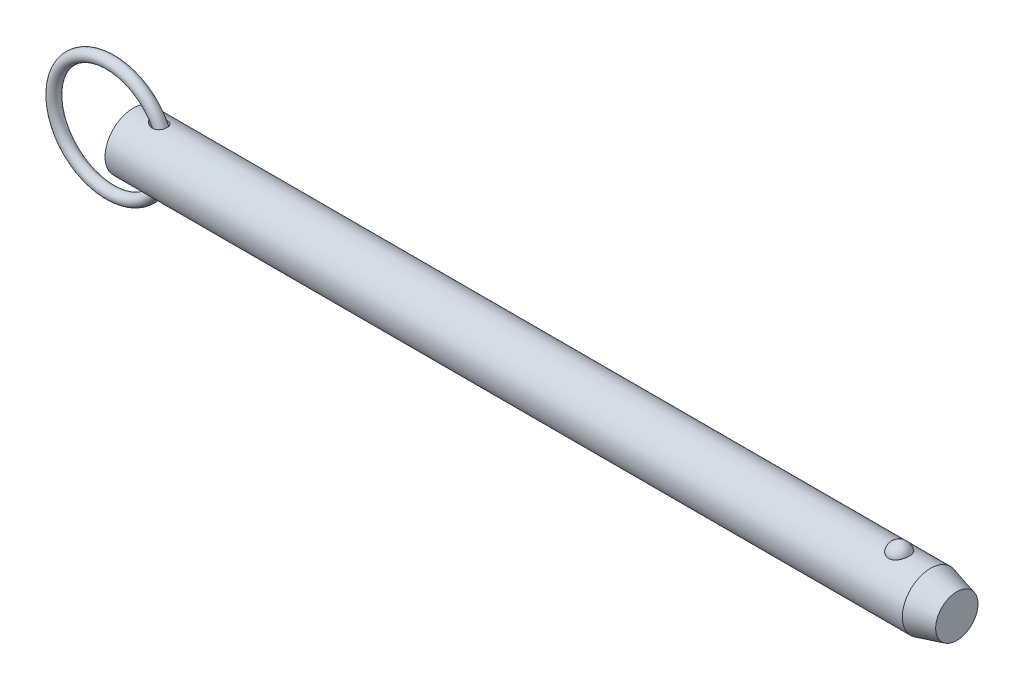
ISO-10303-21;
HEADER;
FILE_DESCRIPTION(('STEP AP214'),'2;1');
FILE_NAME('part.step','',(''),(''),'','','');
FILE_SCHEMA(('AUTOMOTIVE_DESIGN { 1 0 10303 214 1 1 1 1 }'));
ENDSEC;
DATA;
#1=APPLICATION_CONTEXT('core data for automotive mechanical design processes');
#2=APPLICATION_PROTOCOL_DEFINITION('international standard','automotive_design',2000,#1);
#3=PRODUCT_CONTEXT('',#1,'mechanical');
#4=PRODUCT('Part','Part','',(#3));
#5=PRODUCT_RELATED_PRODUCT_CATEGORY('part','',(#4));
#6=PRODUCT_DEFINITION_FORMATION('','',#4);
#7=PRODUCT_DEFINITION_CONTEXT('part definition',#1,'design');
#8=PRODUCT_DEFINITION('design','',#6,#7);
#9=PRODUCT_DEFINITION_SHAPE('','',#8);
#10=(LENGTH_UNIT() NAMED_UNIT(*) SI_UNIT(.MILLI.,.METRE.));
#11=(NAMED_UNIT(*) PLANE_ANGLE_UNIT() SI_UNIT($,.RADIAN.));
#12=(NAMED_UNIT(*) SI_UNIT($,.STERADIAN.) SOLID_ANGLE_UNIT());
#13=UNCERTAINTY_MEASURE_WITH_UNIT(LENGTH_MEASURE(1.E-05),#10,'distance_accuracy_value','');
#14=(GEOMETRIC_REPRESENTATION_CONTEXT(3) GLOBAL_UNCERTAINTY_ASSIGNED_CONTEXT((#13)) GLOBAL_UNIT_ASSIGNED_CONTEXT((#10,
#11,#12)) REPRESENTATION_CONTEXT('',''));
#15=CARTESIAN_POINT('',(0.,0.,0.));
#16=DIRECTION('',(0.,0.,1.));
#17=DIRECTION('',(1.,0.,0.));
#18=AXIS2_PLACEMENT_3D('',#15,#16,#17);
#19=CARTESIAN_POINT('',(-6.46799987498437,0.,0.));
#20=DIRECTION('',(0.,0.,1.));
#21=DIRECTION('',(1.,0.,0.));
#22=AXIS2_PLACEMENT_3D('',#19,#20,#21);
#23=TOROIDAL_SURFACE('',#22,15.875,1.588);
#24=CARTESIAN_POINT('',(10.9950001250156,0.,0.));
#25=VERTEX_POINT('',#24);
#26=VERTEX_LOOP('',#25);
#27=FACE_BOUND('',#26,.T.);
#28=ADVANCED_FACE('P0_F12',(#27),#23,.T.);
#29=CLOSED_SHELL('',(#28));
#30=MANIFOLD_SOLID_BREP('P0_B1',#29);
#31=CARTESIAN_POINT('',(0.,0.,0.));
#32=DIRECTION('',(1.,0.,0.));
#33=DIRECTION('',(0.,0.,-1.));
#34=AXIS2_PLACEMENT_3D('',#31,#32,#33);
#35=CYLINDRICAL_SURFACE('',#34,7.94);
#36=CARTESIAN_POINT('',(4.99454278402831,7.92831028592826,-0.430692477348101));
#37=CARTESIAN_POINT('',(5.02621962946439,7.92271974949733,-0.533554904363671));
#38=CARTESIAN_POINT('',(5.06869972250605,7.91528872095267,-0.633052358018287));
#39=CARTESIAN_POINT('',(5.17094751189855,7.89785690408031,-0.822566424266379));
#40=CARTESIAN_POINT('',(5.23077290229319,7.88784755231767,-0.912550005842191));
#41=CARTESIAN_POINT('',(5.37866013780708,7.8639674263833,-1.10117829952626));
#42=CARTESIAN_POINT('',(5.47004908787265,7.84973599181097,-1.19714712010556));
#43=CARTESIAN_POINT('',(5.66695490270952,7.82090787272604,-1.37293476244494));
#44=CARTESIAN_POINT('',(5.77247743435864,7.80631104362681,-1.45274707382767));
#45=CARTESIAN_POINT('',(5.99604254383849,7.77793596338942,-1.59776875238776));
#46=CARTESIAN_POINT('',(6.11428384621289,7.76417836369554,-1.66267404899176));
#47=CARTESIAN_POINT('',(6.35882685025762,7.73912410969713,-1.77564129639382));
#48=CARTESIAN_POINT('',(6.48513256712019,7.72782869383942,-1.82369477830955));
#49=CARTESIAN_POINT('',(6.76898453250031,7.70705630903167,-1.90977520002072));
#50=CARTESIAN_POINT('',(6.92778004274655,7.69837706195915,-1.94395681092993));
#51=CARTESIAN_POINT('',(7.24915504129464,7.6881294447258,-1.98412381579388));
#52=CARTESIAN_POINT('',(7.41173039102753,7.68655363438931,-1.99013871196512));
#53=CARTESIAN_POINT('',(7.697714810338,7.69094561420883,-1.97306069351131));
#54=CARTESIAN_POINT('',(7.82153338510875,7.69526202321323,-1.95634328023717));
#55=CARTESIAN_POINT('',(8.06460511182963,7.70859273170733,-1.90314615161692));
#56=CARTESIAN_POINT('',(8.18386164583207,7.7176034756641,-1.86668139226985));
#57=CARTESIAN_POINT('',(8.41450663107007,7.73959050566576,-1.77331230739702));
#58=CARTESIAN_POINT('',(8.52585042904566,7.75258738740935,-1.71630154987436));
#59=CARTESIAN_POINT('',(8.73575290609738,7.7809705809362,-1.58263416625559));
#60=CARTESIAN_POINT('',(8.83431445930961,7.7963563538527,-1.50598196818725));
#61=CARTESIAN_POINT('',(9.00639839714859,7.8259635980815,-1.34315626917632));
#62=CARTESIAN_POINT('',(9.08139772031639,7.84016008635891,-1.25853389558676));
#63=CARTESIAN_POINT('',(9.21545590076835,7.86710959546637,-1.07729126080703));
#64=CARTESIAN_POINT('',(9.27451869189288,7.87986297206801,-0.980673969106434));
#65=CARTESIAN_POINT('',(9.37315031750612,7.90198817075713,-0.782161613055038));
#66=CARTESIAN_POINT('',(9.41336512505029,7.91146854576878,-0.68059867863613));
#67=CARTESIAN_POINT('',(9.47650914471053,7.92664976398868,-0.471967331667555));
#68=CARTESIAN_POINT('',(9.49943917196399,7.93235078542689,-0.364899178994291));
#69=CARTESIAN_POINT('',(9.5274466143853,7.93934369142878,-0.14863226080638));
#70=CARTESIAN_POINT('',(9.53257574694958,7.9406483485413,-0.0394405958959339));
#71=CARTESIAN_POINT('',(9.52501411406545,7.93874464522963,0.178286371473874));
#72=CARTESIAN_POINT('',(9.51232314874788,7.93553623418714,0.286821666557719));
#73=CARTESIAN_POINT('',(9.46937875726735,7.92494527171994,0.500278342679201));
#74=CARTESIAN_POINT('',(9.43910562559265,7.9175580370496,0.605195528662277));
#75=CARTESIAN_POINT('',(9.36168926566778,7.8994090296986,0.808294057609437));
#76=CARTESIAN_POINT('',(9.3145467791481,7.88864740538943,0.906475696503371));
#77=CARTESIAN_POINT('',(9.20464679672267,7.86494645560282,1.09319438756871));
#78=CARTESIAN_POINT('',(9.14191093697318,7.85201015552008,1.18174456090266));
#79=CARTESIAN_POINT('',(9.00249124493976,7.82536913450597,1.34692675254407));
#80=CARTESIAN_POINT('',(8.92580850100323,7.81166447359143,1.42355969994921));
#81=CARTESIAN_POINT('',(8.76033130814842,7.78490157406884,1.56333296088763));
#82=CARTESIAN_POINT('',(8.67148512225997,7.77184644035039,1.62641250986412));
#83=CARTESIAN_POINT('',(8.48457694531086,7.74778101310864,1.73744892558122));
#84=CARTESIAN_POINT('',(8.38651410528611,7.73677090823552,1.78540439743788));
#85=CARTESIAN_POINT('',(8.18013312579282,7.71742695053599,1.86728938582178));
#86=CARTESIAN_POINT('',(8.07156725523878,7.7092102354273,1.90061897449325));
#87=CARTESIAN_POINT('',(7.85050876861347,7.6966502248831,1.95085652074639));
#88=CARTESIAN_POINT('',(7.73801453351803,7.69230854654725,1.967757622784));
#89=CARTESIAN_POINT('',(7.50002163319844,7.6873799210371,1.98693391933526));
#90=CARTESIAN_POINT('',(7.37438052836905,7.68722739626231,1.98751701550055));
#91=CARTESIAN_POINT('',(7.12435864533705,7.69142268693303,1.97121025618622));
#92=CARTESIAN_POINT('',(6.99997834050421,7.6957721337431,1.9543140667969));
#93=CARTESIAN_POINT('',(6.73521978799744,7.70925573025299,1.90049277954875));
#94=CARTESIAN_POINT('',(6.59543541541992,7.71903968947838,1.86081454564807));
#95=CARTESIAN_POINT('',(6.32319848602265,7.74233460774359,1.76138158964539));
#96=CARTESIAN_POINT('',(6.19076082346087,7.75585282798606,1.7015877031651));
#97=CARTESIAN_POINT('',(5.99269110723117,7.7785835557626,1.59336057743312));
#98=CARTESIAN_POINT('',(5.92332049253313,7.78707101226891,1.55151799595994));
#99=CARTESIAN_POINT('',(5.78862576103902,7.80440479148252,1.46183267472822));
#100=CARTESIAN_POINT('',(5.72330291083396,7.81325122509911,1.41398807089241));
#101=CARTESIAN_POINT('',(5.53492618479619,7.83980388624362,1.26162857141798));
#102=CARTESIAN_POINT('',(5.41884115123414,7.85759887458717,1.14795556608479));
#103=CARTESIAN_POINT('',(5.25731156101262,7.88350844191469,0.948390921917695));
#104=CARTESIAN_POINT('',(5.20241173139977,7.89260196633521,0.87019982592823));
#105=CARTESIAN_POINT('',(5.10541071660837,7.90897737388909,0.70602680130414));
#106=CARTESIAN_POINT('',(5.06329682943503,7.91626105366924,0.620052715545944));
#107=CARTESIAN_POINT('',(4.99458837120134,7.92827352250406,0.440665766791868));
#108=CARTESIAN_POINT('',(4.96816655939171,7.93297382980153,0.347182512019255));
#109=CARTESIAN_POINT('',(4.94275291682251,7.93751024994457,0.204498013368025));
#110=CARTESIAN_POINT('',(4.93665149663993,7.9386033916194,0.156529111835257));
#111=CARTESIAN_POINT('',(4.92932198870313,7.93991739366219,0.0602142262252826));
#112=CARTESIAN_POINT('',(4.92809242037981,7.94013851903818,0.011868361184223));
#113=CARTESIAN_POINT('',(4.93104052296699,7.93960920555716,-0.103241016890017));
#114=CARTESIAN_POINT('',(4.93747289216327,7.93845361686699,-0.169956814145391));
#115=CARTESIAN_POINT('',(4.95939910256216,7.93453812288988,-0.301777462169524));
#116=CARTESIAN_POINT('',(4.97489225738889,7.9317783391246,-0.36688243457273));
#117=CARTESIAN_POINT('',(4.99454278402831,7.92831028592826,-0.430692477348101));
#118=B_SPLINE_CURVE_WITH_KNOTS('',3,(#36,#37,#38,#39,#40,#41,#42,#43,#44,#45,#46,#47,#48,#49,
#50,#51,#52,#53,#54,#55,#56,#57,#58,#59,#60,#61,#62,#63,#64,#65,#66,#67,#68,#69,#70,#71,#72,#73,
#74,#75,#76,#77,#78,#79,#80,#81,#82,#83,#84,#85,#86,#87,#88,#89,#90,#91,#92,#93,#94,#95,#96,#97,
#98,#99,#100,#101,#102,#103,#104,#105,#106,#107,#108,#109,#110,#111,#112,#113,#114,#115,#116,
#117),.UNSPECIFIED.,.T.,.F.,(4,2,2,2,2,2,2,2,2,2,2,2,2,2,2,2,2,2,2,2,2,2,2,2,2,2,2,2,2,2,2,2,2,
2,2,2,2,2,2,2,4),(0.,0.323000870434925,0.647088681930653,1.04479679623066,1.4426648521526,
1.84804279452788,2.25362416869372,2.73917777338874,3.2242226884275,3.59772765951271,
3.97095014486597,4.34613445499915,4.72123425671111,5.06140749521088,5.40149668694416,
5.72887751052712,6.05624289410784,6.38265637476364,6.70907351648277,7.03585720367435,
7.36262652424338,7.68894495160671,8.01523792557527,8.34296459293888,8.67072147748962,
9.01089033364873,9.35120108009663,9.72668268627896,10.1023004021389,10.5375309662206,
10.9736138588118,11.2176803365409,11.461822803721,11.9480055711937,12.2349837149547,
12.5216758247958,12.8114683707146,12.9563497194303,13.1011870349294,13.3015737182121,
13.5019452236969),.UNSPECIFIED.);
#119=CARTESIAN_POINT('',(4.99454278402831,7.92831028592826,-0.430692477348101));
#120=VERTEX_POINT('',#119);
#121=EDGE_CURVE('P1_E40',#120,#120,#118,.T.);
#122=ORIENTED_EDGE('',*,*,#121,.T.);
#123=EDGE_LOOP('',(#122));
#124=FACE_BOUND('',#123,.T.);
#125=CARTESIAN_POINT('',(224.371879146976,0.,0.));
#126=DIRECTION('',(1.,0.,0.));
#127=DIRECTION('',(0.,0.,-1.));
#128=AXIS2_PLACEMENT_3D('',#125,#126,#127);
#129=CIRCLE('',#128,7.94);
#130=CARTESIAN_POINT('',(224.371879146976,0.,-7.94));
#131=VERTEX_POINT('',#130);
#132=EDGE_CURVE('P1_E25',#131,#131,#129,.T.);
#133=ORIENTED_EDGE('',*,*,#132,.F.);
#134=EDGE_LOOP('',(#133));
#135=FACE_BOUND('',#134,.T.);
#136=CARTESIAN_POINT('',(0.,0.,0.));
#137=DIRECTION('',(1.,0.,0.));
#138=DIRECTION('',(0.,0.,-1.));
#139=AXIS2_PLACEMENT_3D('',#136,#137,#138);
#140=CIRCLE('',#139,7.94);
#141=CARTESIAN_POINT('',(0.,0.,-7.94));
#142=VERTEX_POINT('',#141);
#143=EDGE_CURVE('P1_E9',#142,#142,#140,.T.);
#144=ORIENTED_EDGE('',*,*,#143,.T.);
#145=EDGE_LOOP('',(#144));
#146=FACE_BOUND('',#145,.T.);
#147=CARTESIAN_POINT('',(215.564907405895,7.37767842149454,2.93486986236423));
#148=CARTESIAN_POINT('',(215.412749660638,7.3776732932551,2.93487505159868));
#149=CARTESIAN_POINT('',(215.260632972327,7.38258419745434,2.92262454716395));
#150=CARTESIAN_POINT('',(214.960928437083,7.40163229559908,2.87404196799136));
#151=CARTESIAN_POINT('',(214.813339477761,7.41576720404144,2.83771585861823));
#152=CARTESIAN_POINT('',(214.527018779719,7.4516157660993,2.74218769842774));
#153=CARTESIAN_POINT('',(214.388274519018,7.47331841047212,2.68301886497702));
#154=CARTESIAN_POINT('',(214.122882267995,7.52194082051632,2.54350967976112));
#155=CARTESIAN_POINT('',(213.996236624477,7.54886159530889,2.46316523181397));
#156=CARTESIAN_POINT('',(213.754534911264,7.60594671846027,2.28090375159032));
#157=CARTESIAN_POINT('',(213.639906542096,7.63618114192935,2.1784421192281));
#158=CARTESIAN_POINT('',(213.428878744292,7.69614046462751,1.95608495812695));
#159=CARTESIAN_POINT('',(213.332482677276,7.72586526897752,1.83618622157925));
#160=CARTESIAN_POINT('',(213.155938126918,7.78314821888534,1.57628086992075));
#161=CARTESIAN_POINT('',(213.076707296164,7.81055035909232,1.43561546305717));
#162=CARTESIAN_POINT('',(212.941797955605,7.85879631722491,1.142363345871));
#163=CARTESIAN_POINT('',(212.886121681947,7.87963951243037,0.989775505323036));
#164=CARTESIAN_POINT('',(212.79881215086,7.91289645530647,0.674619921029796));
#165=CARTESIAN_POINT('',(212.76753090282,7.92518652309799,0.511941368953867));
#166=CARTESIAN_POINT('',(212.730975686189,7.93958930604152,0.183247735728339));
#167=CARTESIAN_POINT('',(212.725701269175,7.94170219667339,0.0172327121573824));
#168=CARTESIAN_POINT('',(212.741231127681,7.93554931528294,-0.312672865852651));
#169=CARTESIAN_POINT('',(212.761925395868,7.92732732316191,-0.476569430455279));
#170=CARTESIAN_POINT('',(212.82878655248,7.90141534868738,-0.798305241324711));
#171=CARTESIAN_POINT('',(212.874953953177,7.88372517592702,-0.956144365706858));
#172=CARTESIAN_POINT('',(212.991898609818,7.84066230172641,-1.26152073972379));
#173=CARTESIAN_POINT('',(213.062704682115,7.81528060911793,-1.40904568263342));
#174=CARTESIAN_POINT('',(213.227478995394,7.75948672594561,-1.68950598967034));
#175=CARTESIAN_POINT('',(213.321448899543,7.72907417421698,-1.82244030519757));
#176=CARTESIAN_POINT('',(213.530839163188,7.66640424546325,-2.07032792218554));
#177=CARTESIAN_POINT('',(213.646315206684,7.63414223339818,-2.18523308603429));
#178=CARTESIAN_POINT('',(213.8959006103,7.57149681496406,-2.39329737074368));
#179=CARTESIAN_POINT('',(214.030008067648,7.54111321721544,-2.48645870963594));
#180=CARTESIAN_POINT('',(214.310111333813,7.48650742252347,-2.64628132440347));
#181=CARTESIAN_POINT('',(214.455760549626,7.46215900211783,-2.71350554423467));
#182=CARTESIAN_POINT('',(214.757425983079,7.42171253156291,-2.82226614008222));
#183=CARTESIAN_POINT('',(214.913438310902,7.40561140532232,-2.86381209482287));
#184=CARTESIAN_POINT('',(215.222970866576,7.38426796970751,-2.9183907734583));
#185=CARTESIAN_POINT('',(215.376222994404,7.37852109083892,-2.93275024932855));
#186=CARTESIAN_POINT('',(215.683070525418,7.37700973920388,-2.93655208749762));
#187=CARTESIAN_POINT('',(215.836665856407,7.38124333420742,-2.92599927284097));
#188=CARTESIAN_POINT('',(216.134990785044,7.39890635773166,-2.88102897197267));
#189=CARTESIAN_POINT('',(216.279848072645,7.41205491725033,-2.84733999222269));
#190=CARTESIAN_POINT('',(216.56164329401,7.445801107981,-2.75788206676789));
#191=CARTESIAN_POINT('',(216.698580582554,7.46639934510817,-2.70211132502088));
#192=CARTESIAN_POINT('',(216.964061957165,7.51339098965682,-2.56858908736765));
#193=CARTESIAN_POINT('',(217.092354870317,7.53990200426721,-2.4903806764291));
#194=CARTESIAN_POINT('',(217.334244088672,7.59569503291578,-2.31462737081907));
#195=CARTESIAN_POINT('',(217.447837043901,7.6249776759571,-2.21707808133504));
#196=CARTESIAN_POINT('',(217.66322156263,7.68489473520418,-1.99982049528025));
#197=CARTESIAN_POINT('',(217.764148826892,7.71552419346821,-1.87925337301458));
#198=CARTESIAN_POINT('',(217.945186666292,7.77353016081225,-1.6226882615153));
#199=CARTESIAN_POINT('',(218.025293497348,7.80090608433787,-1.48668750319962));
#200=CARTESIAN_POINT('',(218.165361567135,7.85047992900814,-1.1981841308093));
#201=CARTESIAN_POINT('',(218.224587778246,7.87248183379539,-1.04529016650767));
#202=CARTESIAN_POINT('',(218.317982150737,7.90785114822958,-0.731080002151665));
#203=CARTESIAN_POINT('',(218.352149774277,7.92121837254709,-0.569763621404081));
#204=CARTESIAN_POINT('',(218.394795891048,7.93797834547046,-0.242812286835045));
#205=CARTESIAN_POINT('',(218.403204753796,7.94134405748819,-0.0771668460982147));
#206=CARTESIAN_POINT('',(218.393962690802,7.93767937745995,0.253276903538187));
#207=CARTESIAN_POINT('',(218.376312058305,7.93064910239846,0.418075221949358));
#208=CARTESIAN_POINT('',(218.315424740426,7.90695571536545,0.741525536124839));
#209=CARTESIAN_POINT('',(218.272281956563,7.8903279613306,0.900197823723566));
#210=CARTESIAN_POINT('',(218.16135358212,7.84916386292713,1.20759654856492));
#211=CARTESIAN_POINT('',(218.09356656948,7.82462706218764,1.35632241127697));
#212=CARTESIAN_POINT('',(217.934371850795,7.77006699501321,1.64032869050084));
#213=CARTESIAN_POINT('',(217.842861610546,7.74002008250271,1.7755471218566));
#214=CARTESIAN_POINT('',(217.638296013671,7.67774175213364,2.0280064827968));
#215=CARTESIAN_POINT('',(217.525241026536,7.64551037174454,2.14524772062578));
#216=CARTESIAN_POINT('',(217.280831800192,7.58265895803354,2.35778002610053));
#217=CARTESIAN_POINT('',(217.149583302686,7.5520309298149,2.45319004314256));
#218=CARTESIAN_POINT('',(216.871601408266,7.49579792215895,2.61999897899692));
#219=CARTESIAN_POINT('',(216.724867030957,7.47019326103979,2.69139637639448));
#220=CARTESIAN_POINT('',(216.412947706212,7.42622216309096,2.8105324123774));
#221=CARTESIAN_POINT('',(216.247220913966,7.40825002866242,2.85700910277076));
#222=CARTESIAN_POINT('',(215.909279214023,7.38398348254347,2.9191685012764));
#223=CARTESIAN_POINT('',(215.73706702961,7.3776842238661,2.93486399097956));
#224=CARTESIAN_POINT('',(215.564907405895,7.37767842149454,2.93486986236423));
#225=B_SPLINE_CURVE_WITH_KNOTS('',3,(#147,#148,#149,#150,#151,#152,#153,#154,#155,#156,#157,
#158,#159,#160,#161,#162,#163,#164,#165,#166,#167,#168,#169,#170,#171,#172,#173,#174,#175,#176,
#177,#178,#179,#180,#181,#182,#183,#184,#185,#186,#187,#188,#189,#190,#191,#192,#193,#194,#195,
#196,#197,#198,#199,#200,#201,#202,#203,#204,#205,#206,#207,#208,#209,#210,#211,#212,#213,#214,
#215,#216,#217,#218,#219,#220,#221,#222,#223,#224),.UNSPECIFIED.,.T.,.F.,(4,2,2,2,2,2,2,2,2,2,2,
2,2,2,2,2,2,2,2,2,2,2,2,2,2,2,2,2,2,2,2,2,2,2,2,2,2,2,4),(0.,0.455841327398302,
0.911569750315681,1.36663794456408,1.82179423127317,2.2897898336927,2.75787163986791,
3.24685368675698,3.73588214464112,4.23184282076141,4.72779494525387,5.22165321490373,
5.71552141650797,6.20996917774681,6.7044524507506,7.20023431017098,7.69596557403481,
8.18023418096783,8.66432203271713,9.12410697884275,9.58380291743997,10.0296503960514,
10.4755341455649,10.9312349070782,11.3870393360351,11.8654416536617,12.3439299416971,
12.8378875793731,13.3318558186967,13.8271581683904,14.3224549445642,14.8159385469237,
15.3094506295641,15.8051323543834,16.3008055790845,16.7937101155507,17.2866458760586,
17.8026240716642,18.3183879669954),.UNSPECIFIED.);
#226=CARTESIAN_POINT('',(215.564907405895,7.37767842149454,2.93486986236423));
#227=VERTEX_POINT('',#226);
#228=EDGE_CURVE('P1_E34',#227,#227,#225,.T.);
#229=ORIENTED_EDGE('',*,*,#228,.T.);
#230=EDGE_LOOP('',(#229));
#231=FACE_BOUND('',#230,.T.);
#232=CARTESIAN_POINT('',(4.99454278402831,-7.92831028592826,-0.430692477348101));
#233=CARTESIAN_POINT('',(4.97033227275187,-7.93258231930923,-0.352006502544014));
#234=CARTESIAN_POINT('',(4.95238785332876,-7.93578782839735,-0.271213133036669));
#235=CARTESIAN_POINT('',(4.93055628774,-7.93969351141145,-0.107590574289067));
#236=CARTESIAN_POINT('',(4.92668686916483,-7.9403905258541,-0.0247589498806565));
#237=CARTESIAN_POINT('',(4.9333808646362,-7.93918950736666,0.140249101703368));
#238=CARTESIAN_POINT('',(4.94393526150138,-7.93729309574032,0.222425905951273));
#239=CARTESIAN_POINT('',(4.97854187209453,-7.93113325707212,0.383746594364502));
#240=CARTESIAN_POINT('',(5.00259804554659,-7.92686913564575,0.462889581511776));
#241=CARTESIAN_POINT('',(5.06904511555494,-7.91526143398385,0.633278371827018));
#242=CARTESIAN_POINT('',(5.11430124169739,-7.90744739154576,0.723368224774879));
#243=CARTESIAN_POINT('',(5.21873327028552,-7.88988375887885,0.894880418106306));
#244=CARTESIAN_POINT('',(5.27793532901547,-7.88013053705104,0.976286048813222));
#245=CARTESIAN_POINT('',(5.42949971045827,-7.85602233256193,1.15646341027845));
#246=CARTESIAN_POINT('',(5.52624420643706,-7.84124381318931,1.25147911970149));
#247=CARTESIAN_POINT('',(5.73364751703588,-7.81163164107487,1.42469165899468));
#248=CARTESIAN_POINT('',(5.84432059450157,-7.79679794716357,1.50287102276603));
#249=CARTESIAN_POINT('',(6.07871104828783,-7.76824211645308,1.64418004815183));
#250=CARTESIAN_POINT('',(6.20267992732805,-7.75455572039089,1.70689813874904));
#251=CARTESIAN_POINT('',(6.45850163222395,-7.73013259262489,1.81429879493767));
#252=CARTESIAN_POINT('',(6.59035778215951,-7.71939711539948,1.85897369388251));
#253=CARTESIAN_POINT('',(6.88209177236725,-7.70072462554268,1.93500734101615));
#254=CARTESIAN_POINT('',(7.04295460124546,-7.69356120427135,1.96286607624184));
#255=CARTESIAN_POINT('',(7.36724421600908,-7.68676336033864,1.98935053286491));
#256=CARTESIAN_POINT('',(7.53066723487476,-7.68711875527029,1.98801578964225));
#257=CARTESIAN_POINT('',(7.81370255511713,-7.69496475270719,1.95735673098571));
#258=CARTESIAN_POINT('',(7.93413357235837,-7.70066491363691,1.93505220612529));
#259=CARTESIAN_POINT('',(8.16950597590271,-7.71642704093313,1.87121573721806));
#260=CARTESIAN_POINT('',(8.28445128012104,-7.72648584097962,1.82969774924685));
#261=CARTESIAN_POINT('',(8.50557964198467,-7.75006886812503,1.72707806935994));
#262=CARTESIAN_POINT('',(8.61171927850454,-7.76360905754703,1.66588583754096));
#263=CARTESIAN_POINT('',(8.810712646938,-7.79249659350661,1.52503518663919));
#264=CARTESIAN_POINT('',(8.90356827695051,-7.80784368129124,1.44537941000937));
#265=CARTESIAN_POINT('',(9.06550151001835,-7.83702302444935,1.27723027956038));
#266=CARTESIAN_POINT('',(9.1359139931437,-7.85087516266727,1.19002179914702));
#267=CARTESIAN_POINT('',(9.26060432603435,-7.87675706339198,1.00451336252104));
#268=CARTESIAN_POINT('',(9.31488561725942,-7.88878721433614,0.906215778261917));
#269=CARTESIAN_POINT('',(9.40446618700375,-7.90930761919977,0.70456335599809));
#270=CARTESIAN_POINT('',(9.44028687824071,-7.91789338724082,0.601449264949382));
#271=CARTESIAN_POINT('',(9.49451523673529,-7.93109531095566,0.390496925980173));
#272=CARTESIAN_POINT('',(9.51292345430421,-7.93571159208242,0.282658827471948));
#273=CARTESIAN_POINT('',(9.53189686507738,-7.94047189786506,0.0654759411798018));
#274=CARTESIAN_POINT('',(9.53248611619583,-7.94062195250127,-0.0438666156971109));
#275=CARTESIAN_POINT('',(9.51587068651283,-7.93644929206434,-0.26110665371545));
#276=CARTESIAN_POINT('',(9.49866585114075,-7.93212653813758,-0.369004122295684));
#277=CARTESIAN_POINT('',(9.44682594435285,-7.91946859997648,-0.58038072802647));
#278=CARTESIAN_POINT('',(9.412176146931,-7.91113002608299,-0.683856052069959));
#279=CARTESIAN_POINT('',(9.32626198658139,-7.89134774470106,-0.883337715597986));
#280=CARTESIAN_POINT('',(9.27499851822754,-7.87990420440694,-0.979344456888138));
#281=CARTESIAN_POINT('',(9.15725058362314,-7.8551872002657,-1.1610523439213));
#282=CARTESIAN_POINT('',(9.09078836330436,-7.84191642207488,-1.24676827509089));
#283=CARTESIAN_POINT('',(8.94443523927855,-7.81498501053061,-1.40574704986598));
#284=CARTESIAN_POINT('',(8.86454527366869,-7.80132440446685,-1.47901076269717));
#285=CARTESIAN_POINT('',(8.69307774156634,-7.77497848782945,-1.61181253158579));
#286=CARTESIAN_POINT('',(8.60142539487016,-7.76230033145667,-1.67125525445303));
#287=CARTESIAN_POINT('',(8.40957687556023,-7.73928987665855,-1.77477159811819));
#288=CARTESIAN_POINT('',(8.30937953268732,-7.72895790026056,-1.81884310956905));
#289=CARTESIAN_POINT('',(8.0986350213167,-7.71113842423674,-1.89300673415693));
#290=CARTESIAN_POINT('',(7.98782526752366,-7.70379913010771,-1.92238394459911));
#291=CARTESIAN_POINT('',(7.76294389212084,-7.69313871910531,-1.96460780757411));
#292=CARTESIAN_POINT('',(7.64887102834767,-7.68981915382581,-1.9774480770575));
#293=CARTESIAN_POINT('',(7.40716929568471,-7.68706358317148,-1.98813881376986));
#294=CARTESIAN_POINT('',(7.27945620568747,-7.68810537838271,-1.98414471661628));
#295=CARTESIAN_POINT('',(7.02593945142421,-7.6946815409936,-1.95847707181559));
#296=CARTESIAN_POINT('',(6.90013720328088,-7.7002190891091,-1.93679100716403));
#297=CARTESIAN_POINT('',(6.63265145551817,-7.71617635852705,-1.87230070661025));
#298=CARTESIAN_POINT('',(6.49169161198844,-7.72724102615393,-1.82664736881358));
#299=CARTESIAN_POINT('',(6.21840602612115,-7.75282261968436,-1.71482542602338));
#300=CARTESIAN_POINT('',(6.08608498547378,-7.76734140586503,-1.64864576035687));
#301=CARTESIAN_POINT('',(5.84453114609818,-7.7967744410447,-1.50297952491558));
#302=CARTESIAN_POINT('',(5.73429128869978,-7.81154606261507,-1.4251373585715));
#303=CARTESIAN_POINT('',(5.52761180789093,-7.84104229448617,-1.25271210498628));
#304=CARTESIAN_POINT('',(5.43116004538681,-7.85576693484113,-1.15814390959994));
#305=CARTESIAN_POINT('',(5.27970568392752,-7.87984260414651,-0.978603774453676));
#306=CARTESIAN_POINT('',(5.22040249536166,-7.88960721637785,-0.897319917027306));
#307=CARTESIAN_POINT('',(5.11583115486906,-7.90718602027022,-0.726171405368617));
#308=CARTESIAN_POINT('',(5.07050564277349,-7.9150081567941,-0.636343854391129));
#309=CARTESIAN_POINT('',(5.01937588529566,-7.92393751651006,-0.506165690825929));
#310=CARTESIAN_POINT('',(5.00622932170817,-7.926248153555,-0.468674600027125));
#311=CARTESIAN_POINT('',(4.99454278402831,-7.92831028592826,-0.430692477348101));
#312=B_SPLINE_CURVE_WITH_KNOTS('',3,(#232,#233,#234,#235,#236,#237,#238,#239,#240,#241,#242,
#243,#244,#245,#246,#247,#248,#249,#250,#251,#252,#253,#254,#255,#256,#257,#258,#259,#260,#261,
#262,#263,#264,#265,#266,#267,#268,#269,#270,#271,#272,#273,#274,#275,#276,#277,#278,#279,#280,
#281,#282,#283,#284,#285,#286,#287,#288,#289,#290,#291,#292,#293,#294,#295,#296,#297,#298,#299,
#300,#301,#302,#303,#304,#305,#306,#307,#308,#309,#310,#311),.UNSPECIFIED.,.T.,.F.,(4,2,2,2,2,2,
2,2,2,2,2,2,2,2,2,2,2,2,2,2,2,2,2,2,2,2,2,2,2,2,2,2,2,2,2,2,2,2,2,4),(0.,0.247186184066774,
0.494683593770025,0.742026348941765,0.989441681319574,1.29115800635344,1.59344478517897,
2.00047108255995,2.40791761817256,2.82525860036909,3.2427767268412,3.7304673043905,
4.21749746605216,4.58380730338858,4.94985148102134,5.31760488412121,5.68530568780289,
6.02244390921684,6.35951015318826,6.68644714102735,7.01337379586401,7.33985903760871,
7.66634711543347,7.9931112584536,8.31985780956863,8.64612913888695,8.97237768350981,
9.30081392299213,9.62929521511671,9.9724956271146,10.3158284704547,10.6977037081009,
11.0798493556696,11.523823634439,11.9680375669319,12.3738595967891,12.7793221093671,
13.0815405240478,13.3825016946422,13.5018197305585),.UNSPECIFIED.);
#313=CARTESIAN_POINT('',(4.99454278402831,-7.92831028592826,-0.430692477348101));
#314=VERTEX_POINT('',#313);
#315=EDGE_CURVE('P1_E17',#314,#314,#312,.T.);
#316=ORIENTED_EDGE('',*,*,#315,.T.);
#317=EDGE_LOOP('',(#316));
#318=FACE_BOUND('',#317,.T.);
#319=ADVANCED_FACE('P1_F13',(#124,#135,#146,#231,#318),#35,.T.);
#320=CARTESIAN_POINT('',(0.,0.,0.));
#321=DIRECTION('',(-1.,0.,0.));
#322=DIRECTION('',(0.,0.,1.));
#323=AXIS2_PLACEMENT_3D('',#320,#321,#322);
#324=PLANE('',#323);
#325=ORIENTED_EDGE('',*,*,#143,.F.);
#326=EDGE_LOOP('',(#325));
#327=FACE_BOUND('',#326,.T.);
#328=ADVANCED_FACE('P1_F15',(#327),#324,.T.);
#329=CARTESIAN_POINT('',(231.78,0.,0.));
#330=DIRECTION('',(-1.,0.,0.));
#331=DIRECTION('',(0.,0.,1.));
#332=AXIS2_PLACEMENT_3D('',#329,#330,#331);
#333=CONICAL_SURFACE('',#332,5.95500000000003,0.26179938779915);
#334=ORIENTED_EDGE('',*,*,#132,.T.);
#335=EDGE_LOOP('',(#334));
#336=FACE_BOUND('',#335,.T.);
#337=CARTESIAN_POINT('',(231.78,0.,0.));
#338=DIRECTION('',(1.,0.,0.));
#339=DIRECTION('',(0.,0.,-1.));
#340=AXIS2_PLACEMENT_3D('',#337,#338,#339);
#341=CIRCLE('',#340,5.95500000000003);
#342=CARTESIAN_POINT('',(231.78,0.,-5.95500000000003));
#343=VERTEX_POINT('',#342);
#344=EDGE_CURVE('P1_E30',#343,#343,#341,.T.);
#345=ORIENTED_EDGE('',*,*,#344,.F.);
#346=EDGE_LOOP('',(#345));
#347=FACE_BOUND('',#346,.T.);
#348=ADVANCED_FACE('P1_F55',(#336,#347),#333,.T.);
#349=CARTESIAN_POINT('',(231.78,5.95500000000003,0.));
#350=DIRECTION('',(1.,0.,0.));
#351=DIRECTION('',(0.,0.,-1.));
#352=AXIS2_PLACEMENT_3D('',#349,#350,#351);
#353=PLANE('',#352);
#354=ORIENTED_EDGE('',*,*,#344,.T.);
#355=EDGE_LOOP('',(#354));
#356=FACE_BOUND('',#355,.T.);
#357=ADVANCED_FACE('P1_F51',(#356),#353,.T.);
#358=CARTESIAN_POINT('',(215.564907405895,7.146,0.));
#359=DIRECTION('',(-1.,0.,0.));
#360=DIRECTION('',(0.,-1.,0.));
#361=AXIS2_PLACEMENT_3D('',#358,#359,#360);
#362=SPHERICAL_SURFACE('',#361,2.944);
#363=ORIENTED_EDGE('',*,*,#228,.F.);
#364=EDGE_LOOP('',(#363));
#365=FACE_BOUND('',#364,.T.);
#366=ADVANCED_FACE('P1_F46',(#365),#362,.T.);
#367=CARTESIAN_POINT('',(-6.46799987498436,0.,0.));
#368=DIRECTION('',(0.,0.,1.));
#369=DIRECTION('',(1.,0.,0.));
#370=AXIS2_PLACEMENT_3D('',#367,#368,#369);
#371=TOROIDAL_SURFACE('',#370,15.875,1.985);
#372=ORIENTED_EDGE('',*,*,#315,.F.);
#373=EDGE_LOOP('',(#372));
#374=FACE_BOUND('',#373,.T.);
#375=ORIENTED_EDGE('',*,*,#121,.F.);
#376=EDGE_LOOP('',(#375));
#377=FACE_BOUND('',#376,.T.);
#378=ADVANCED_FACE('P1_F50',(#374,#377),#371,.F.);
#379=CLOSED_SHELL('',(#319,#328,#348,#357,#366,#378));
#380=MANIFOLD_SOLID_BREP('P1_B1',#379);
#381=ADVANCED_BREP_SHAPE_REPRESENTATION('',(#18,#30,#380),#14);
#382=SHAPE_DEFINITION_REPRESENTATION(#9,#381);
ENDSEC;
END-ISO-10303-21;
